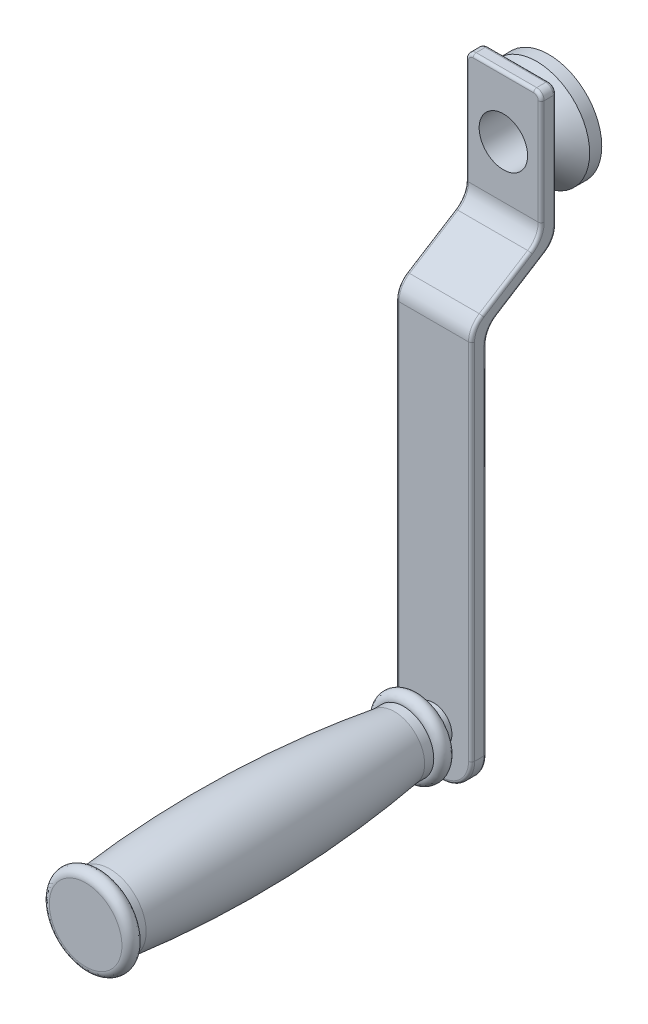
from build123d import *

# Parameters (mm, degrees)
ESQUISSE1_W                     = 190
ESQUISSE1_H                     = 28
BOSS_EXTRU_1_DEPTH              = 25
ESQUISSE2_W                     = 23
ESQUISSE2_H                     = 55.858980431
ENL_V_MAT_EXTRU_1_DEPTH         = 194.672403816
ESQUISSE3_W                     = 23
ESQUISSE3_H                     = 131.380339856
ENL_V_MAT_EXTRU_2_DEPTH         = 194.672403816
D_POUILLE1_ANGLE                = 32.190665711
D_POUILLE2_ANGLE                = 32.190665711
ESQUISSE5_W                     = 8
ESQUISSE5_H                     = 2
DIAM_TRE_DU_PER_AGE_16_0_16_1_D = 16
CONG_1_R                        = 2.5
CONG_2_R                        = 7.5
CONG_3_R                        = 10
CONG_4_R                        = 1


with BuildPart() as part:
    # Esquisse1 → Boss.-Extru.1 (new body)
    with BuildSketch(Plane(origin=(-12.5, 0, 0), x_dir=(0, -1, 0), z_dir=(-1, 0, 0))):
        with Locations((-95, -14)):
            Rectangle(ESQUISSE1_W, ESQUISSE1_H)
    extrude(amount=-BOSS_EXTRU_1_DEPTH)

    # Esquisse2 → Enl_v. mat.-Extru.1 (cut, through all)
    with BuildSketch(Plane(origin=(12.5, 0, 0), x_dir=(0, 0, -1), z_dir=(1, 0, 0))):
        with Locations((11.5, 162.070509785)):
            Rectangle(ESQUISSE2_W, ESQUISSE2_H)
    extrude(amount=-ENL_V_MAT_EXTRU_1_DEPTH, mode=Mode.SUBTRACT)

    # Esquisse3 → Enl_v. mat.-Extru.2 (cut, through all)
    with BuildSketch(Plane(origin=(12.5, 0, 0), x_dir=(0, 0, -1), z_dir=(1, 0, 0))):
        with Locations((16.5, 65.690169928)):
            Rectangle(ESQUISSE3_W, ESQUISSE3_H)
    extrude(amount=-ENL_V_MAT_EXTRU_2_DEPTH, mode=Mode.SUBTRACT)

    # D_pouille1
    d_pouille1_faces = [part.faces().sort_by_distance(p)[0] for p in [
        (0, 134.141019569, -11.5),
    ]]
    draft(d_pouille1_faces, Plane(origin=(12.5, 0, 0), x_dir=(1, 0, 0), z_dir=(0, 0, 1)), D_POUILLE1_ANGLE)

    # D_pouille2
    d_pouille2_faces = [part.faces().sort_by_distance(p)[0] for p in [
        (0, 131.380339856, -16.5),
    ]]
    draft(d_pouille2_faces, Plane(origin=(-12.5, 131.380339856, -5), x_dir=(0, -1, 0), z_dir=(0, 0, -1)), D_POUILLE2_ANGLE)

    # Esquisse4 → R_volution1 (revolve)
    with BuildSketch(Plane(origin=(0, 15, 0), x_dir=(1, 0, 0), z_dir=(0, 1, 0))):
        with BuildLine():
            Line((6, 0), (0, 0))
            Line((0, 0), (0, -115))
            Line((0, -115), (12, -115))
            add(Edge.make_bspline(
                [(12, -110), (12.279809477, -110), (12.563477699, -110.048309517), (12.827513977, -110.140928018), (13.091550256, -110.233546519), (13.343237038, -110.373028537), (13.561732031, -110.547823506), (13.780227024, -110.722618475), (13.971556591, -110.937547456), (14.119876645, -111.174812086), (14.2681967, -111.412076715), (14.377598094, -111.678221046), (14.439021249, -111.95120555), (14.500444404, -112.224190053), (14.515583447, -112.51154398), (14.483184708, -112.789471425), (14.450785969, -113.067398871), (14.36995585, -113.343565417), (14.247387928, -113.595101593), (14.124820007, -113.846637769), (13.957133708, -114.080481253), (13.758215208, -114.277267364), (13.559296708, -114.474053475), (13.323659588, -114.639209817), (13.07081706, -114.759059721), (12.817974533, -114.878909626), (12.540952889, -114.956758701), (12.262692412, -114.986160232), (12.175492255, -114.995373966), (12.087685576, -115), (12, -115)],
                knots=[0, 0, 0, 0, 0.000839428, 0.000839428, 0.000839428, 0.001678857, 0.001678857, 0.001678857, 0.002518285, 0.002518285, 0.002518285, 0.003357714, 0.003357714, 0.003357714, 0.004197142, 0.004197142, 0.004197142, 0.005036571, 0.005036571, 0.005036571, 0.005875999, 0.005875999, 0.005875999, 0.006715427, 0.006715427, 0.006715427, 0.007554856, 0.007554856, 0.007554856, 0.007814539, 0.007814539, 0.007814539, 0.007814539], degree=3))
            Line((12, -110), (12, -107))
            ThreePointArc((12, -107), (13.913883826, -59.938002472), (10, -13))
            Line((10, -13), (10, -10))
            add(Edge.make_bspline(
                [(10, -5), (10.279809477, -5), (10.563477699, -5.048309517), (10.827513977, -5.140928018), (11.091550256, -5.233546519), (11.343237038, -5.373028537), (11.561732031, -5.547823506), (11.780227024, -5.722618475), (11.971556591, -5.937547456), (12.119876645, -6.174812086), (12.2681967, -6.412076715), (12.377598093, -6.678221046), (12.439021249, -6.95120555), (12.500444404, -7.224190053), (12.515583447, -7.51154398), (12.483184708, -7.789471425), (12.450785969, -8.067398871), (12.36995585, -8.343565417), (12.247387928, -8.595101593), (12.124820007, -8.846637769), (11.957133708, -9.080481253), (11.758215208, -9.277267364), (11.559296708, -9.474053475), (11.323659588, -9.639209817), (11.07081706, -9.759059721), (10.817974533, -9.878909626), (10.540952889, -9.956758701), (10.262692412, -9.986160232), (10.175492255, -9.995373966), (10.087685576, -10), (10, -10)],
                knots=[0, 0, 0, 0, 0.000839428, 0.000839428, 0.000839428, 0.001678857, 0.001678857, 0.001678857, 0.002518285, 0.002518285, 0.002518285, 0.003357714, 0.003357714, 0.003357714, 0.004197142, 0.004197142, 0.004197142, 0.005036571, 0.005036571, 0.005036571, 0.005875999, 0.005875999, 0.005875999, 0.006715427, 0.006715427, 0.006715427, 0.007554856, 0.007554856, 0.007554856, 0.007814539, 0.007814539, 0.007814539, 0.007814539], degree=3))
            Line((10, -5), (6, -5))
            Line((6, -5), (6, 0))
        make_face()
    revolve(axis=Axis((0, 15, 0), (0, 0, 1)))

    # Esquisse5 → R_volution2 (revolve)
    with BuildSketch(Plane.XZ.offset(-15)):
        with Locations((4, -6)):
            Rectangle(ESQUISSE5_W, ESQUISSE5_H)
    revolve(axis=Axis((0, 15, -5), (0, 0, -1)))

    # Esquisse6 → R_volution3 (revolve)
    with BuildSketch(Plane(origin=(0, 170, 0), x_dir=(1, 0, 0), z_dir=(0, 1, 0))):
        Polygon((17.5, 38), (0, 38), (0, 28), (10, 28), (17.5, 34), align=None)
    revolve(axis=Axis((0, 170, -38), (0, 0, 1)))

    # Diam_tre du per_age _16.0 _16_1 (through all)
    with Locations(Plane.XY.offset(-23)):
        with Locations((0, 170)):
            Hole(DIAM_TRE_DU_PER_AGE_16_0_16_1_D / 2)

    # Cong_1
    cong_1_edges = [part.edges().sort_by_distance(p)[0] for p in [
        (-12.5, 190, -25.5),
        (12.5, 190, -25.5),
    ]]
    fillet(cong_1_edges, radius=CONG_1_R)

    # Cong_2
    cong_2_edges = [part.edges().sort_by_distance(p)[0] for p in [
        (0, 148.619660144, -23),
        (0, 134.141019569, 0),
        (0, 145.858980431, -28),
        (0, 131.380339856, -5),
    ]]
    fillet(cong_2_edges, radius=CONG_2_R)

    # Cong_3
    cong_3_edges = [part.edges().sort_by_distance(p)[0] for p in [
        (-12.5, 0, -2.5),
        (12.5, 0, -2.5),
    ]]
    fillet(cong_3_edges, radius=CONG_3_R)

    # Cong_4
    cong_4_edges = [part.edges().sort_by_distance(p)[0] for p in [
        (-12.5, 70, 0),
        (12.5, 70, 0),
        (0, 0, 0),
        (9.571067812, 2.928932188, 0),
        (-9.571067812, 2.928932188, 0),
        (0, 0, -5),
        (9.571067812, 2.928932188, -5),
        (-9.571067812, 2.928932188, -5),
        (0, 190, -23),
        (0, 190, -28),
        (-12.5, 168.75, -28),
        (12.5, 168.75, -28),
        (-11.767766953, 189.267766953, -28),
        (11.767766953, 189.267766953, -28),
        (-11.767766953, 189.267766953, -23),
        (11.767766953, 189.267766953, -23),
        (12.5, 170.130339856, -23),
        (-12.5, 170.130339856, -23),
        (12.5, 141.380339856, -11.5),
        (-12.5, 141.380339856, -11.5),
        (12.5, 68.619660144, -5),
        (-12.5, 68.619660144, -5),
        (12.5, 138.619660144, -16.5),
        (-12.5, 138.619660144, -16.5),
        (12.5, 133.625152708, -0.93431132),
        (12.5, 146.374847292, -27.06568868),
        (-12.5, 133.625152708, -0.93431132),
        (-12.5, 146.374847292, -27.06568868),
        (12.5, 149.135527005, -22.06568868),
        (-12.5, 149.135527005, -22.06568868),
        (12.5, 130.864472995, -5.93431132),
        (-12.5, 130.864472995, -5.93431132),
    ]]
    fillet(cong_4_edges, radius=CONG_4_R)


solid = part.part
